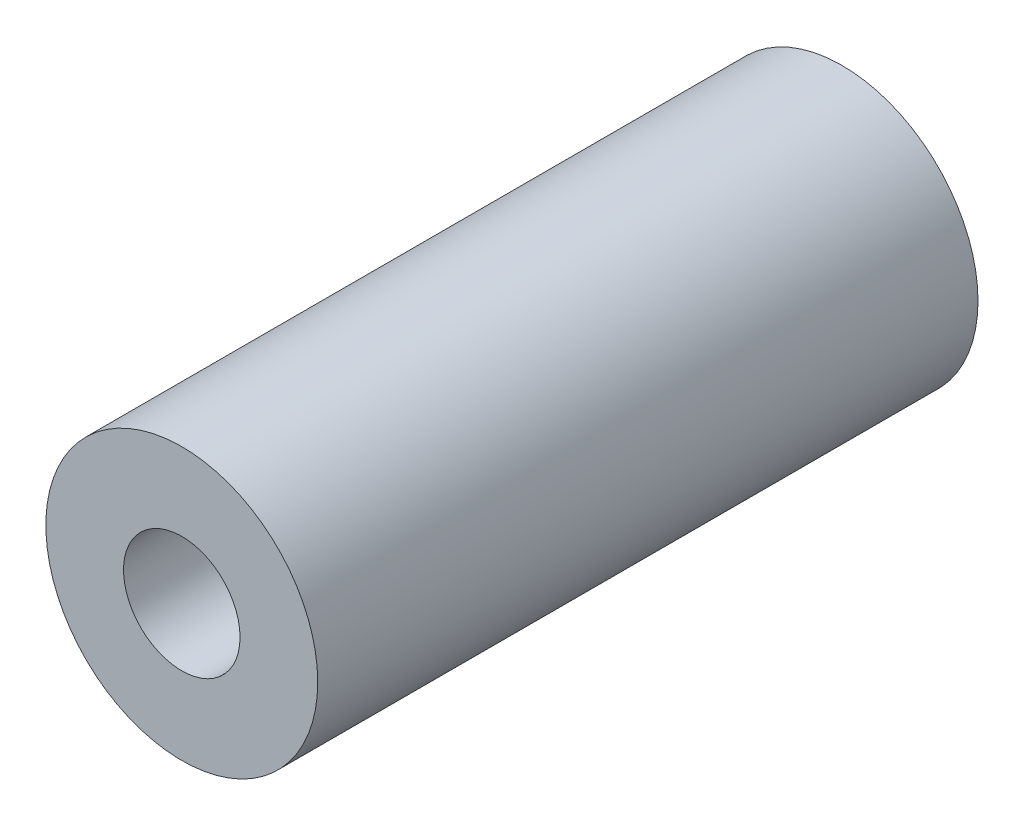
ISO-10303-21;
HEADER;
FILE_DESCRIPTION(('STEP AP214'),'2;1');
FILE_NAME('part.step','',(''),(''),'','','');
FILE_SCHEMA(('AUTOMOTIVE_DESIGN { 1 0 10303 214 1 1 1 1 }'));
ENDSEC;
DATA;
#1=APPLICATION_CONTEXT('core data for automotive mechanical design processes');
#2=APPLICATION_PROTOCOL_DEFINITION('international standard','automotive_design',2000,#1);
#3=PRODUCT_CONTEXT('',#1,'mechanical');
#4=PRODUCT('Part','Part','',(#3));
#5=PRODUCT_RELATED_PRODUCT_CATEGORY('part','',(#4));
#6=PRODUCT_DEFINITION_FORMATION('','',#4);
#7=PRODUCT_DEFINITION_CONTEXT('part definition',#1,'design');
#8=PRODUCT_DEFINITION('design','',#6,#7);
#9=PRODUCT_DEFINITION_SHAPE('','',#8);
#10=(LENGTH_UNIT() NAMED_UNIT(*) SI_UNIT(.MILLI.,.METRE.));
#11=(NAMED_UNIT(*) PLANE_ANGLE_UNIT() SI_UNIT($,.RADIAN.));
#12=(NAMED_UNIT(*) SI_UNIT($,.STERADIAN.) SOLID_ANGLE_UNIT());
#13=UNCERTAINTY_MEASURE_WITH_UNIT(LENGTH_MEASURE(1.E-05),#10,'distance_accuracy_value','');
#14=(GEOMETRIC_REPRESENTATION_CONTEXT(3) GLOBAL_UNCERTAINTY_ASSIGNED_CONTEXT((#13)) GLOBAL_UNIT_ASSIGNED_CONTEXT((#10,
#11,#12)) REPRESENTATION_CONTEXT('',''));
#15=CARTESIAN_POINT('',(0.,0.,0.));
#16=DIRECTION('',(0.,0.,1.));
#17=DIRECTION('',(1.,0.,0.));
#18=AXIS2_PLACEMENT_3D('',#15,#16,#17);
#19=CARTESIAN_POINT('',(0.,0.,53.975));
#20=DIRECTION('',(0.,0.,1.));
#21=DIRECTION('',(1.,0.,0.));
#22=AXIS2_PLACEMENT_3D('',#19,#20,#21);
#23=PLANE('',#22);
#24=CARTESIAN_POINT('',(0.,0.,53.975));
#25=DIRECTION('',(0.,0.,1.));
#26=DIRECTION('',(1.,0.,0.));
#27=AXIS2_PLACEMENT_3D('',#24,#25,#26);
#28=CIRCLE('',#27,11.1125);
#29=CARTESIAN_POINT('',(11.1125,0.,53.975));
#30=VERTEX_POINT('',#29);
#31=EDGE_CURVE('E10',#30,#30,#28,.T.);
#32=ORIENTED_EDGE('',*,*,#31,.T.);
#33=EDGE_LOOP('',(#32));
#34=FACE_BOUND('',#33,.T.);
#35=CARTESIAN_POINT('',(0.,0.,53.975));
#36=DIRECTION('',(0.,0.,1.));
#37=DIRECTION('',(1.,0.,0.));
#38=AXIS2_PLACEMENT_3D('',#35,#36,#37);
#39=CIRCLE('',#38,4.7625);
#40=CARTESIAN_POINT('',(4.7625,0.,53.975));
#41=VERTEX_POINT('',#40);
#42=EDGE_CURVE('E43',#41,#41,#39,.T.);
#43=ORIENTED_EDGE('',*,*,#42,.F.);
#44=EDGE_LOOP('',(#43));
#45=FACE_BOUND('',#44,.T.);
#46=ADVANCED_FACE('F32',(#34,#45),#23,.T.);
#47=CARTESIAN_POINT('',(0.,0.,0.));
#48=DIRECTION('',(0.,0.,1.));
#49=DIRECTION('',(1.,0.,0.));
#50=AXIS2_PLACEMENT_3D('',#47,#48,#49);
#51=PLANE('',#50);
#52=CARTESIAN_POINT('',(0.,0.,0.));
#53=DIRECTION('',(0.,0.,1.));
#54=DIRECTION('',(1.,0.,0.));
#55=AXIS2_PLACEMENT_3D('',#52,#53,#54);
#56=CIRCLE('',#55,11.1125);
#57=CARTESIAN_POINT('',(11.1125,0.,0.));
#58=VERTEX_POINT('',#57);
#59=EDGE_CURVE('E36',#58,#58,#56,.T.);
#60=ORIENTED_EDGE('',*,*,#59,.F.);
#61=EDGE_LOOP('',(#60));
#62=FACE_BOUND('',#61,.T.);
#63=CARTESIAN_POINT('',(0.,0.,0.));
#64=DIRECTION('',(0.,0.,1.));
#65=DIRECTION('',(1.,0.,0.));
#66=AXIS2_PLACEMENT_3D('',#63,#64,#65);
#67=CIRCLE('',#66,4.7625);
#68=CARTESIAN_POINT('',(4.7625,0.,0.));
#69=VERTEX_POINT('',#68);
#70=EDGE_CURVE('E45',#69,#69,#67,.T.);
#71=ORIENTED_EDGE('',*,*,#70,.T.);
#72=EDGE_LOOP('',(#71));
#73=FACE_BOUND('',#72,.T.);
#74=ADVANCED_FACE('F55',(#62,#73),#51,.F.);
#75=CARTESIAN_POINT('',(0.,0.,53.975));
#76=DIRECTION('',(0.,0.,-1.));
#77=DIRECTION('',(-1.,0.,0.));
#78=AXIS2_PLACEMENT_3D('',#75,#76,#77);
#79=CYLINDRICAL_SURFACE('',#78,11.1125);
#80=ORIENTED_EDGE('',*,*,#31,.F.);
#81=EDGE_LOOP('',(#80));
#82=FACE_BOUND('',#81,.T.);
#83=ORIENTED_EDGE('',*,*,#59,.T.);
#84=EDGE_LOOP('',(#83));
#85=FACE_BOUND('',#84,.T.);
#86=ADVANCED_FACE('F34',(#82,#85),#79,.T.);
#87=CARTESIAN_POINT('',(0.,0.,53.975));
#88=DIRECTION('',(0.,0.,-1.));
#89=DIRECTION('',(-1.,0.,0.));
#90=AXIS2_PLACEMENT_3D('',#87,#88,#89);
#91=CYLINDRICAL_SURFACE('',#90,4.7625);
#92=ORIENTED_EDGE('',*,*,#42,.T.);
#93=EDGE_LOOP('',(#92));
#94=FACE_BOUND('',#93,.T.);
#95=ORIENTED_EDGE('',*,*,#70,.F.);
#96=EDGE_LOOP('',(#95));
#97=FACE_BOUND('',#96,.T.);
#98=ADVANCED_FACE('F51',(#94,#97),#91,.F.);
#99=CLOSED_SHELL('',(#46,#74,#86,#98));
#100=MANIFOLD_SOLID_BREP('B2',#99);
#101=ADVANCED_BREP_SHAPE_REPRESENTATION('',(#18,#100),#14);
#102=SHAPE_DEFINITION_REPRESENTATION(#9,#101);
ENDSEC;
END-ISO-10303-21;
